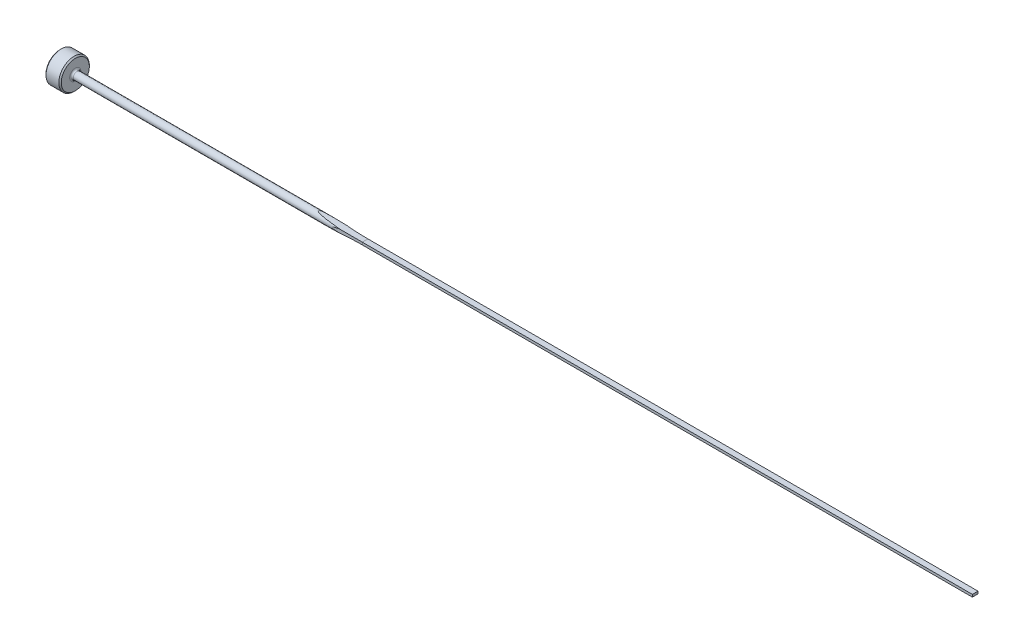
from build123d import *

# Parameters (mm, degrees)
CUT_EXTRUDE1_DEPTH = 191.552909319
CUT_EXTRUDE2_DEPTH = 191.552909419
FILLET1_R          = 0.381
CHAMFER1_SIZE      = 0.254


with BuildPart() as part:
    # Sketch1 → Revolve1 (revolve)
    with BuildSketch(Plane.XY, mode=Mode.PRIVATE) as revolve1_sk:
        Polygon((0, 0), (0, 3.175), (3.175, 3.175), (3.175, 0.79375), (190.5, 0.79375), (190.5, 0), align=None)
    revolve(revolve1_sk.sketch.rotate(Axis((0, 0, 0), (1, 0, 0)), 90), axis=Axis((0, 0, 0), (1, 0, 0)))

    # Sketch2 → Cut-Extrude1 (cut, symmetric)
    with BuildSketch(Plane.XY):
        with BuildLine():
            Line((190.5, 0.79375), (190.5, 0.254))
            Line((190.5, 0.254), (63.5, 0.254))
            ThreePointArc((63.5, 0.254), (58.601848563, 0.389040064), (53.718577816, 0.79375))
            Line((53.718577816, 0.79375), (190.5, 0.79375))
        make_face()
    cut_extrude1 = extrude(amount=CUT_EXTRUDE1_DEPTH, both=True, mode=Mode.SUBTRACT)

    # Mirror1: Cut-Extrude1 across plane
    add(cut_extrude1.mirror(Plane.ZX), mode=Mode.SUBTRACT)

    # Sketch3 → Cut-Extrude2 (cut, symmetric)
    with BuildSketch(Plane(origin=(0, 0, 0), x_dir=(1, 0, 0), z_dir=(0, 1, 0))):
        with BuildLine():
            Line((190.5, 0.79375), (190.5, 0.5842))
            Line((190.5, 0.5842), (63.5, 0.5842))
            ThreePointArc((63.5, 0.5842), (60.44803383, 0.636602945), (57.399665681, 0.79375))
            Line((57.399665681, 0.79375), (190.5, 0.79375))
        make_face()
    cut_extrude2 = extrude(amount=CUT_EXTRUDE2_DEPTH, both=True, mode=Mode.SUBTRACT)

    # Mirror2: Cut-Extrude2 across plane
    add(cut_extrude2.mirror(Plane.XY), mode=Mode.SUBTRACT)

    # Fillet1
    fillet1_edges = [part.edges().sort_by_distance(p)[0] for p in [
        (3.175, 0, -0.79375),
    ]]
    fillet(fillet1_edges, radius=FILLET1_R)

    # Chamfer1
    chamfer1_edges = [part.edges().sort_by_distance(p)[0] for p in [
        (3.175, 0, -3.175),
        (0, 0, -3.175),
    ]]
    chamfer(chamfer1_edges, length=CHAMFER1_SIZE)


solid = part.part
